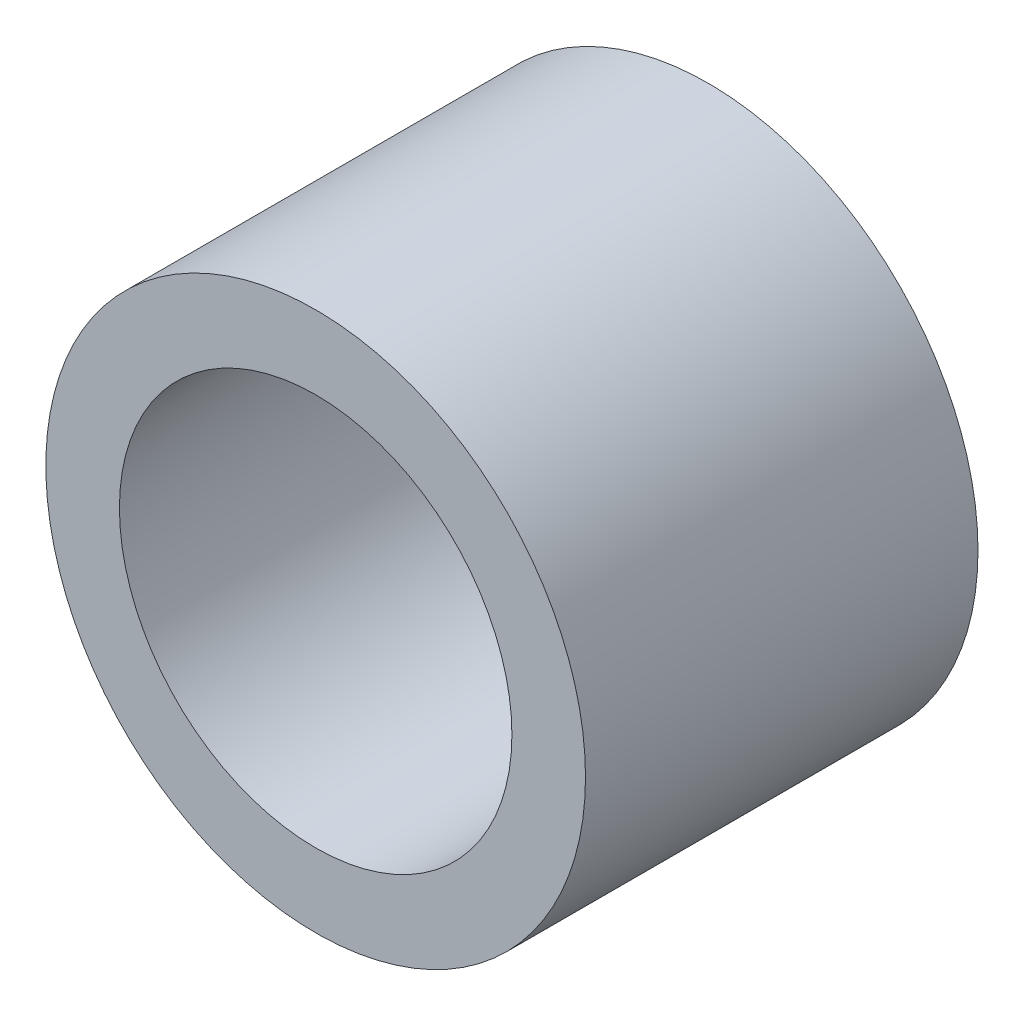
from build123d import *

# Parameters (mm, degrees)
ESQUISSE1_R          = 11
ESQUISSE1_R_2        = 8
BASE_EXTRUSION_DEPTH = 16


with BuildPart() as part:
    # Esquisse1 → Base-Extrusion (new body)
    with BuildSketch(Plane.XY):
        Circle(ESQUISSE1_R)
        Circle(ESQUISSE1_R_2, mode=Mode.SUBTRACT)
    extrude(amount=BASE_EXTRUSION_DEPTH)


solid = part.part
